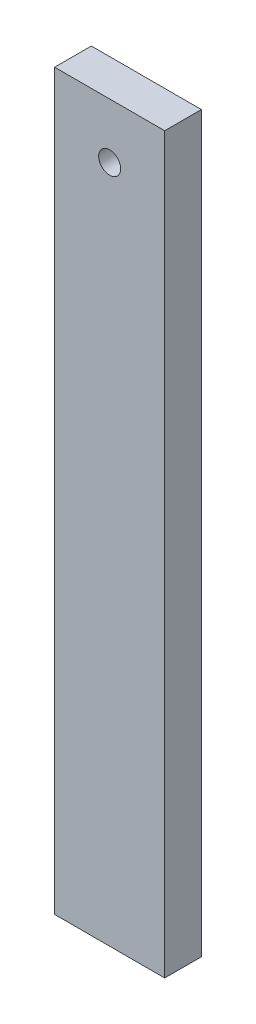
ISO-10303-21;
HEADER;
FILE_DESCRIPTION(('STEP AP214'),'2;1');
FILE_NAME('part.step','',(''),(''),'','','');
FILE_SCHEMA(('AUTOMOTIVE_DESIGN { 1 0 10303 214 1 1 1 1 }'));
ENDSEC;
DATA;
#1=APPLICATION_CONTEXT('core data for automotive mechanical design processes');
#2=APPLICATION_PROTOCOL_DEFINITION('international standard','automotive_design',2000,#1);
#3=PRODUCT_CONTEXT('',#1,'mechanical');
#4=PRODUCT('Part','Part','',(#3));
#5=PRODUCT_RELATED_PRODUCT_CATEGORY('part','',(#4));
#6=PRODUCT_DEFINITION_FORMATION('','',#4);
#7=PRODUCT_DEFINITION_CONTEXT('part definition',#1,'design');
#8=PRODUCT_DEFINITION('design','',#6,#7);
#9=PRODUCT_DEFINITION_SHAPE('','',#8);
#10=(LENGTH_UNIT() NAMED_UNIT(*) SI_UNIT(.MILLI.,.METRE.));
#11=(NAMED_UNIT(*) PLANE_ANGLE_UNIT() SI_UNIT($,.RADIAN.));
#12=(NAMED_UNIT(*) SI_UNIT($,.STERADIAN.) SOLID_ANGLE_UNIT());
#13=UNCERTAINTY_MEASURE_WITH_UNIT(LENGTH_MEASURE(1.E-05),#10,'distance_accuracy_value','');
#14=(GEOMETRIC_REPRESENTATION_CONTEXT(3) GLOBAL_UNCERTAINTY_ASSIGNED_CONTEXT((#13)) GLOBAL_UNIT_ASSIGNED_CONTEXT((#10,
#11,#12)) REPRESENTATION_CONTEXT('',''));
#15=CARTESIAN_POINT('',(0.,0.,0.));
#16=DIRECTION('',(0.,0.,1.));
#17=DIRECTION('',(1.,0.,0.));
#18=AXIS2_PLACEMENT_3D('',#15,#16,#17);
#19=CARTESIAN_POINT('',(0.,0.,50.));
#20=DIRECTION('',(0.,0.,-1.));
#21=DIRECTION('',(-1.,0.,0.));
#22=AXIS2_PLACEMENT_3D('',#19,#20,#21);
#23=PLANE('',#22);
#24=DIRECTION('',(0.,-1.,0.));
#25=VECTOR('',#24,1.);
#26=CARTESIAN_POINT('',(0.,0.,50.));
#27=LINE('',#26,#25);
#28=CARTESIAN_POINT('',(-1.66533453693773E-13,1000.,50.));
#29=VERTEX_POINT('',#28);
#30=CARTESIAN_POINT('',(0.,0.,50.));
#31=VERTEX_POINT('',#30);
#32=EDGE_CURVE('E85',#29,#31,#27,.T.);
#33=ORIENTED_EDGE('',*,*,#32,.T.);
#34=DIRECTION('',(1.,0.,0.));
#35=VECTOR('',#34,1.);
#36=CARTESIAN_POINT('',(0.,0.,50.));
#37=LINE('',#36,#35);
#38=CARTESIAN_POINT('',(150.,0.,50.));
#39=VERTEX_POINT('',#38);
#40=EDGE_CURVE('E80',#31,#39,#37,.T.);
#41=ORIENTED_EDGE('',*,*,#40,.T.);
#42=DIRECTION('',(0.,1.,0.));
#43=VECTOR('',#42,1.);
#44=CARTESIAN_POINT('',(150.,0.,50.));
#45=LINE('',#44,#43);
#46=CARTESIAN_POINT('',(150.,1000.,50.));
#47=VERTEX_POINT('',#46);
#48=EDGE_CURVE('E83',#39,#47,#45,.T.);
#49=ORIENTED_EDGE('',*,*,#48,.T.);
#50=DIRECTION('',(-1.,0.,0.));
#51=VECTOR('',#50,1.);
#52=CARTESIAN_POINT('',(-1.66533453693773E-13,1000.,50.));
#53=LINE('',#52,#51);
#54=EDGE_CURVE('E50',#47,#29,#53,.T.);
#55=ORIENTED_EDGE('',*,*,#54,.T.);
#56=EDGE_LOOP('',(#33,#41,#49,#55));
#57=FACE_BOUND('',#56,.T.);
#58=CARTESIAN_POINT('',(74.9999999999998,925.,50.));
#59=DIRECTION('',(0.,0.,1.));
#60=DIRECTION('',(1.,0.,0.));
#61=AXIS2_PLACEMENT_3D('',#58,#59,#60);
#62=CIRCLE('',#61,15.);
#63=CARTESIAN_POINT('',(89.9999999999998,925.,50.));
#64=VERTEX_POINT('',#63);
#65=EDGE_CURVE('E100',#64,#64,#62,.T.);
#66=ORIENTED_EDGE('',*,*,#65,.F.);
#67=EDGE_LOOP('',(#66));
#68=FACE_BOUND('',#67,.T.);
#69=ADVANCED_FACE('F33',(#57,#68),#23,.F.);
#70=CARTESIAN_POINT('',(0.,0.,0.));
#71=DIRECTION('',(0.,0.,-1.));
#72=DIRECTION('',(-1.,0.,0.));
#73=AXIS2_PLACEMENT_3D('',#70,#71,#72);
#74=PLANE('',#73);
#75=DIRECTION('',(0.,-1.,0.));
#76=VECTOR('',#75,1.);
#77=CARTESIAN_POINT('',(0.,0.,0.));
#78=LINE('',#77,#76);
#79=CARTESIAN_POINT('',(-1.66533453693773E-13,1000.,0.));
#80=VERTEX_POINT('',#79);
#81=CARTESIAN_POINT('',(0.,0.,0.));
#82=VERTEX_POINT('',#81);
#83=EDGE_CURVE('E97',#80,#82,#78,.T.);
#84=ORIENTED_EDGE('',*,*,#83,.F.);
#85=DIRECTION('',(-1.,0.,0.));
#86=VECTOR('',#85,1.);
#87=CARTESIAN_POINT('',(-1.66533453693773E-13,1000.,0.));
#88=LINE('',#87,#86);
#89=CARTESIAN_POINT('',(150.,1000.,0.));
#90=VERTEX_POINT('',#89);
#91=EDGE_CURVE('E73',#90,#80,#88,.T.);
#92=ORIENTED_EDGE('',*,*,#91,.F.);
#93=DIRECTION('',(0.,1.,0.));
#94=VECTOR('',#93,1.);
#95=CARTESIAN_POINT('',(150.,0.,0.));
#96=LINE('',#95,#94);
#97=CARTESIAN_POINT('',(150.,0.,0.));
#98=VERTEX_POINT('',#97);
#99=EDGE_CURVE('E67',#98,#90,#96,.T.);
#100=ORIENTED_EDGE('',*,*,#99,.F.);
#101=DIRECTION('',(1.,0.,0.));
#102=VECTOR('',#101,1.);
#103=CARTESIAN_POINT('',(0.,0.,0.));
#104=LINE('',#103,#102);
#105=EDGE_CURVE('E89',#82,#98,#104,.T.);
#106=ORIENTED_EDGE('',*,*,#105,.F.);
#107=EDGE_LOOP('',(#84,#92,#100,#106));
#108=FACE_BOUND('',#107,.T.);
#109=CARTESIAN_POINT('',(74.9999999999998,925.,0.));
#110=DIRECTION('',(0.,0.,1.));
#111=DIRECTION('',(1.,0.,0.));
#112=AXIS2_PLACEMENT_3D('',#109,#110,#111);
#113=CIRCLE('',#112,15.);
#114=CARTESIAN_POINT('',(89.9999999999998,925.,0.));
#115=VERTEX_POINT('',#114);
#116=EDGE_CURVE('E112',#115,#115,#113,.T.);
#117=ORIENTED_EDGE('',*,*,#116,.T.);
#118=EDGE_LOOP('',(#117));
#119=FACE_BOUND('',#118,.T.);
#120=ADVANCED_FACE('F108',(#108,#119),#74,.T.);
#121=CARTESIAN_POINT('',(0.,0.,50.));
#122=DIRECTION('',(1.,0.,0.));
#123=DIRECTION('',(0.,1.,0.));
#124=AXIS2_PLACEMENT_3D('',#121,#122,#123);
#125=PLANE('',#124);
#126=ORIENTED_EDGE('',*,*,#83,.T.);
#127=DIRECTION('',(0.,0.,-1.));
#128=VECTOR('',#127,1.);
#129=CARTESIAN_POINT('',(0.,0.,50.));
#130=LINE('',#129,#128);
#131=EDGE_CURVE('E11',#31,#82,#130,.T.);
#132=ORIENTED_EDGE('',*,*,#131,.F.);
#133=ORIENTED_EDGE('',*,*,#32,.F.);
#134=DIRECTION('',(0.,0.,-1.));
#135=VECTOR('',#134,1.);
#136=CARTESIAN_POINT('',(-1.66533453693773E-13,1000.,50.));
#137=LINE('',#136,#135);
#138=EDGE_CURVE('E93',#29,#80,#137,.T.);
#139=ORIENTED_EDGE('',*,*,#138,.T.);
#140=EDGE_LOOP('',(#126,#132,#133,#139));
#141=FACE_BOUND('',#140,.T.);
#142=ADVANCED_FACE('F35',(#141),#125,.F.);
#143=CARTESIAN_POINT('',(0.,0.,50.));
#144=DIRECTION('',(0.,1.,0.));
#145=DIRECTION('',(0.,0.,1.));
#146=AXIS2_PLACEMENT_3D('',#143,#144,#145);
#147=PLANE('',#146);
#148=ORIENTED_EDGE('',*,*,#105,.T.);
#149=DIRECTION('',(0.,0.,-1.));
#150=VECTOR('',#149,1.);
#151=CARTESIAN_POINT('',(150.,0.,50.));
#152=LINE('',#151,#150);
#153=EDGE_CURVE('E42',#39,#98,#152,.T.);
#154=ORIENTED_EDGE('',*,*,#153,.F.);
#155=ORIENTED_EDGE('',*,*,#40,.F.);
#156=ORIENTED_EDGE('',*,*,#131,.T.);
#157=EDGE_LOOP('',(#148,#154,#155,#156));
#158=FACE_BOUND('',#157,.T.);
#159=ADVANCED_FACE('F88',(#158),#147,.F.);
#160=CARTESIAN_POINT('',(150.,0.,50.));
#161=DIRECTION('',(-1.,0.,0.));
#162=DIRECTION('',(0.,-1.,0.));
#163=AXIS2_PLACEMENT_3D('',#160,#161,#162);
#164=PLANE('',#163);
#165=ORIENTED_EDGE('',*,*,#99,.T.);
#166=DIRECTION('',(0.,0.,-1.));
#167=VECTOR('',#166,1.);
#168=CARTESIAN_POINT('',(150.,1000.,50.));
#169=LINE('',#168,#167);
#170=EDGE_CURVE('E90',#47,#90,#169,.T.);
#171=ORIENTED_EDGE('',*,*,#170,.F.);
#172=ORIENTED_EDGE('',*,*,#48,.F.);
#173=ORIENTED_EDGE('',*,*,#153,.T.);
#174=EDGE_LOOP('',(#165,#171,#172,#173));
#175=FACE_BOUND('',#174,.T.);
#176=ADVANCED_FACE('F91',(#175),#164,.F.);
#177=CARTESIAN_POINT('',(-1.66533453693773E-13,1000.,50.));
#178=DIRECTION('',(0.,-1.,0.));
#179=DIRECTION('',(0.,0.,-1.));
#180=AXIS2_PLACEMENT_3D('',#177,#178,#179);
#181=PLANE('',#180);
#182=ORIENTED_EDGE('',*,*,#91,.T.);
#183=ORIENTED_EDGE('',*,*,#138,.F.);
#184=ORIENTED_EDGE('',*,*,#54,.F.);
#185=ORIENTED_EDGE('',*,*,#170,.T.);
#186=EDGE_LOOP('',(#182,#183,#184,#185));
#187=FACE_BOUND('',#186,.T.);
#188=ADVANCED_FACE('F105',(#187),#181,.F.);
#189=CARTESIAN_POINT('',(74.9999999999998,925.,50.));
#190=DIRECTION('',(0.,0.,-1.));
#191=DIRECTION('',(-1.,0.,0.));
#192=AXIS2_PLACEMENT_3D('',#189,#190,#191);
#193=CYLINDRICAL_SURFACE('',#192,15.);
#194=ORIENTED_EDGE('',*,*,#65,.T.);
#195=EDGE_LOOP('',(#194));
#196=FACE_BOUND('',#195,.T.);
#197=ORIENTED_EDGE('',*,*,#116,.F.);
#198=EDGE_LOOP('',(#197));
#199=FACE_BOUND('',#198,.T.);
#200=ADVANCED_FACE('F118',(#196,#199),#193,.F.);
#201=CLOSED_SHELL('',(#69,#120,#142,#159,#176,#188,#200));
#202=MANIFOLD_SOLID_BREP('B2',#201);
#203=ADVANCED_BREP_SHAPE_REPRESENTATION('',(#18,#202),#14);
#204=SHAPE_DEFINITION_REPRESENTATION(#9,#203);
ENDSEC;
END-ISO-10303-21;
